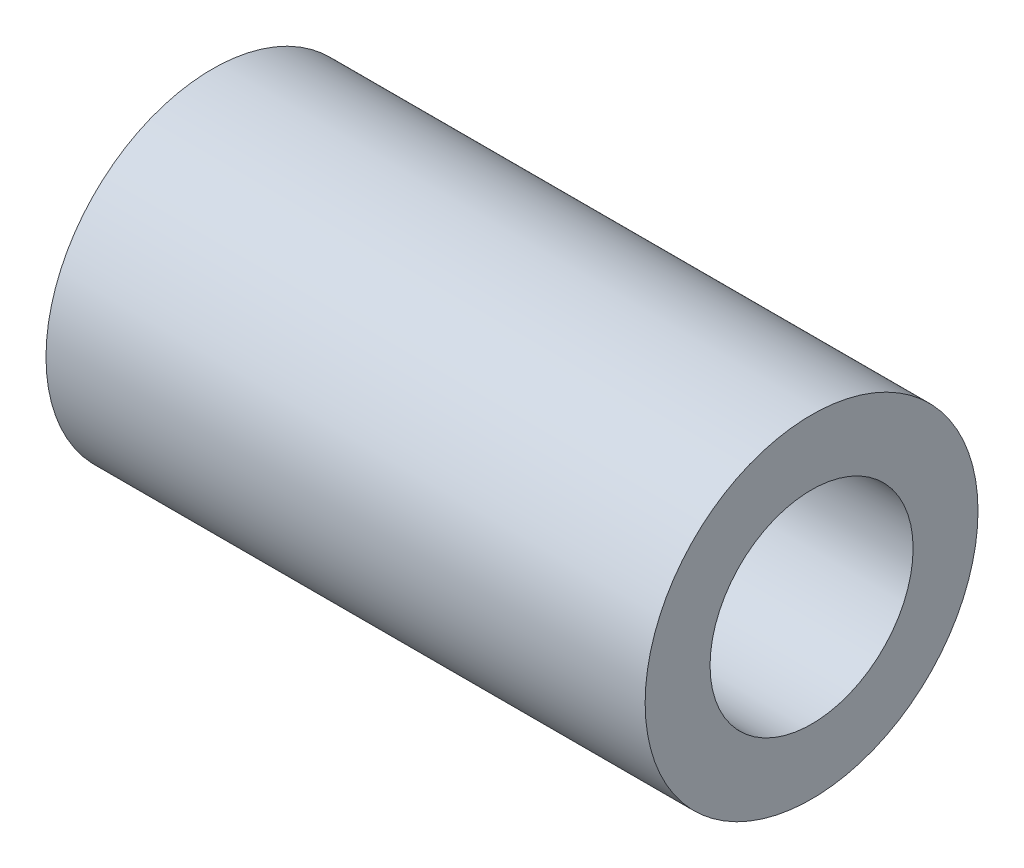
ISO-10303-21;
HEADER;
FILE_DESCRIPTION(('STEP AP214'),'2;1');
FILE_NAME('part.step','',(''),(''),'','','');
FILE_SCHEMA(('AUTOMOTIVE_DESIGN { 1 0 10303 214 1 1 1 1 }'));
ENDSEC;
DATA;
#1=APPLICATION_CONTEXT('core data for automotive mechanical design processes');
#2=APPLICATION_PROTOCOL_DEFINITION('international standard','automotive_design',2000,#1);
#3=PRODUCT_CONTEXT('',#1,'mechanical');
#4=PRODUCT('Part','Part','',(#3));
#5=PRODUCT_RELATED_PRODUCT_CATEGORY('part','',(#4));
#6=PRODUCT_DEFINITION_FORMATION('','',#4);
#7=PRODUCT_DEFINITION_CONTEXT('part definition',#1,'design');
#8=PRODUCT_DEFINITION('design','',#6,#7);
#9=PRODUCT_DEFINITION_SHAPE('','',#8);
#10=(LENGTH_UNIT() NAMED_UNIT(*) SI_UNIT(.MILLI.,.METRE.));
#11=(NAMED_UNIT(*) PLANE_ANGLE_UNIT() SI_UNIT($,.RADIAN.));
#12=(NAMED_UNIT(*) SI_UNIT($,.STERADIAN.) SOLID_ANGLE_UNIT());
#13=UNCERTAINTY_MEASURE_WITH_UNIT(LENGTH_MEASURE(1.E-05),#10,'distance_accuracy_value','');
#14=(GEOMETRIC_REPRESENTATION_CONTEXT(3) GLOBAL_UNCERTAINTY_ASSIGNED_CONTEXT((#13)) GLOBAL_UNIT_ASSIGNED_CONTEXT((#10,
#11,#12)) REPRESENTATION_CONTEXT('',''));
#15=CARTESIAN_POINT('',(0.,0.,0.));
#16=DIRECTION('',(0.,0.,1.));
#17=DIRECTION('',(1.,0.,0.));
#18=AXIS2_PLACEMENT_3D('',#15,#16,#17);
#19=CARTESIAN_POINT('',(18.,0.,0.));
#20=DIRECTION('',(1.,0.,0.));
#21=DIRECTION('',(0.,0.,-1.));
#22=AXIS2_PLACEMENT_3D('',#19,#20,#21);
#23=PLANE('',#22);
#24=CARTESIAN_POINT('',(18.,0.,0.));
#25=DIRECTION('',(1.,0.,0.));
#26=DIRECTION('',(0.,0.,-1.));
#27=AXIS2_PLACEMENT_3D('',#24,#25,#26);
#28=CIRCLE('',#27,5.);
#29=CARTESIAN_POINT('',(18.,0.,-5.));
#30=VERTEX_POINT('',#29);
#31=EDGE_CURVE('E10',#30,#30,#28,.T.);
#32=ORIENTED_EDGE('',*,*,#31,.T.);
#33=EDGE_LOOP('',(#32));
#34=FACE_BOUND('',#33,.T.);
#35=CARTESIAN_POINT('',(18.,0.,0.));
#36=DIRECTION('',(1.,0.,0.));
#37=DIRECTION('',(0.,0.,-1.));
#38=AXIS2_PLACEMENT_3D('',#35,#36,#37);
#39=CIRCLE('',#38,3.05);
#40=CARTESIAN_POINT('',(18.,0.,-3.05));
#41=VERTEX_POINT('',#40);
#42=EDGE_CURVE('E41',#41,#41,#39,.T.);
#43=ORIENTED_EDGE('',*,*,#42,.F.);
#44=EDGE_LOOP('',(#43));
#45=FACE_BOUND('',#44,.T.);
#46=ADVANCED_FACE('F30',(#34,#45),#23,.T.);
#47=CARTESIAN_POINT('',(0.,0.,0.));
#48=DIRECTION('',(1.,0.,0.));
#49=DIRECTION('',(0.,0.,-1.));
#50=AXIS2_PLACEMENT_3D('',#47,#48,#49);
#51=PLANE('',#50);
#52=CARTESIAN_POINT('',(0.,0.,0.));
#53=DIRECTION('',(1.,0.,0.));
#54=DIRECTION('',(0.,0.,-1.));
#55=AXIS2_PLACEMENT_3D('',#52,#53,#54);
#56=CIRCLE('',#55,5.);
#57=CARTESIAN_POINT('',(0.,0.,-5.));
#58=VERTEX_POINT('',#57);
#59=EDGE_CURVE('E34',#58,#58,#56,.T.);
#60=ORIENTED_EDGE('',*,*,#59,.F.);
#61=EDGE_LOOP('',(#60));
#62=FACE_BOUND('',#61,.T.);
#63=CARTESIAN_POINT('',(0.,0.,0.));
#64=DIRECTION('',(1.,0.,0.));
#65=DIRECTION('',(0.,0.,-1.));
#66=AXIS2_PLACEMENT_3D('',#63,#64,#65);
#67=CIRCLE('',#66,3.05);
#68=CARTESIAN_POINT('',(0.,0.,-3.05));
#69=VERTEX_POINT('',#68);
#70=EDGE_CURVE('E43',#69,#69,#67,.T.);
#71=ORIENTED_EDGE('',*,*,#70,.T.);
#72=EDGE_LOOP('',(#71));
#73=FACE_BOUND('',#72,.T.);
#74=ADVANCED_FACE('F53',(#62,#73),#51,.F.);
#75=CARTESIAN_POINT('',(18.,0.,0.));
#76=DIRECTION('',(-1.,0.,0.));
#77=DIRECTION('',(0.,0.,1.));
#78=AXIS2_PLACEMENT_3D('',#75,#76,#77);
#79=CYLINDRICAL_SURFACE('',#78,5.);
#80=ORIENTED_EDGE('',*,*,#31,.F.);
#81=EDGE_LOOP('',(#80));
#82=FACE_BOUND('',#81,.T.);
#83=ORIENTED_EDGE('',*,*,#59,.T.);
#84=EDGE_LOOP('',(#83));
#85=FACE_BOUND('',#84,.T.);
#86=ADVANCED_FACE('F32',(#82,#85),#79,.T.);
#87=CARTESIAN_POINT('',(18.,0.,0.));
#88=DIRECTION('',(-1.,0.,0.));
#89=DIRECTION('',(0.,0.,1.));
#90=AXIS2_PLACEMENT_3D('',#87,#88,#89);
#91=CYLINDRICAL_SURFACE('',#90,3.05);
#92=ORIENTED_EDGE('',*,*,#42,.T.);
#93=EDGE_LOOP('',(#92));
#94=FACE_BOUND('',#93,.T.);
#95=ORIENTED_EDGE('',*,*,#70,.F.);
#96=EDGE_LOOP('',(#95));
#97=FACE_BOUND('',#96,.T.);
#98=ADVANCED_FACE('F49',(#94,#97),#91,.F.);
#99=CLOSED_SHELL('',(#46,#74,#86,#98));
#100=MANIFOLD_SOLID_BREP('B2',#99);
#101=ADVANCED_BREP_SHAPE_REPRESENTATION('',(#18,#100),#14);
#102=SHAPE_DEFINITION_REPRESENTATION(#9,#101);
ENDSEC;
END-ISO-10303-21;
